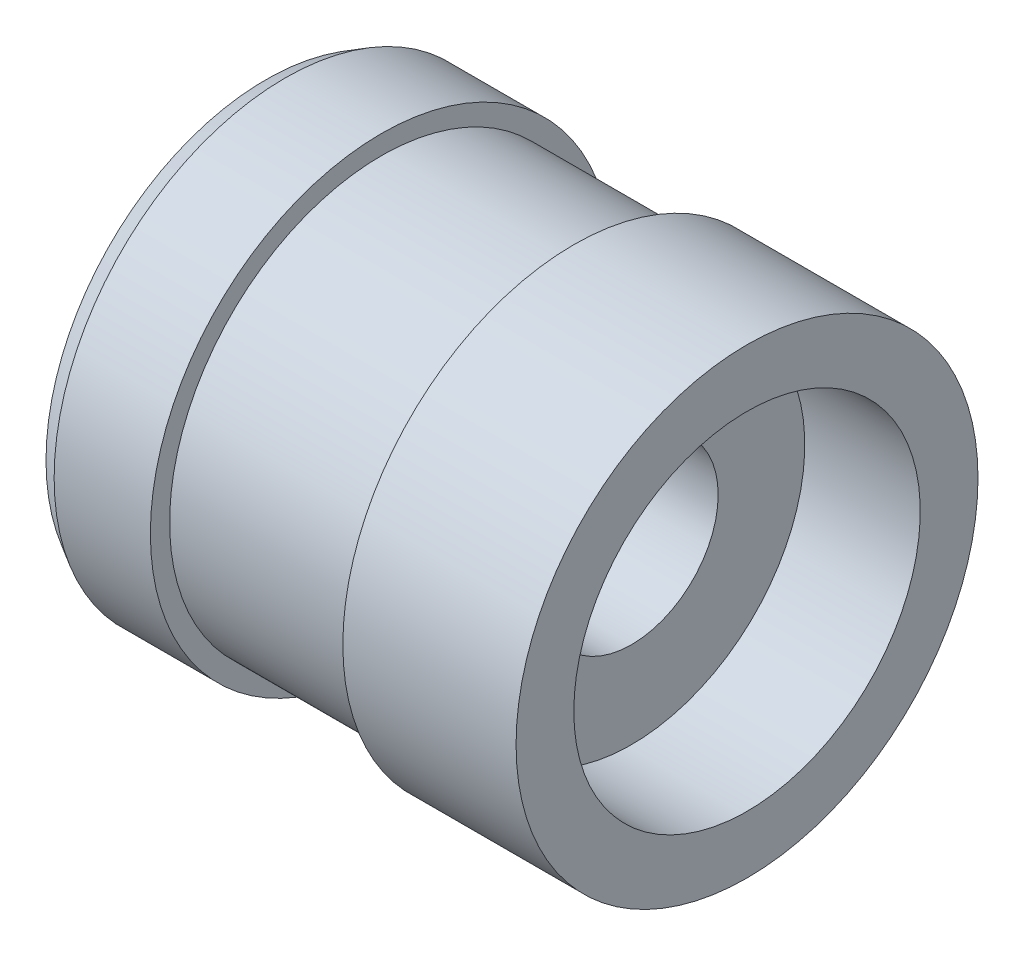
from build123d import *

# Parameters (mm, degrees)
CHANFREIN1_SIZE  = 0.5
CHANFREIN1_SIZE2 = 0.288675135


with BuildPart() as part:
    # Esquisse1 → R_volution1 (revolve)
    with BuildSketch(Plane.XY, mode=Mode.PRIVATE) as r_volution1_sk:
        Polygon((0, 6), (0, 0), (12.5, 0), (12.5, 6), (8, 6), (8, 5.5), (3, 5.5), (3, 6), align=None)
    revolve(r_volution1_sk.sketch.rotate(Axis((0, 0, 0), (1, 0, 0)), 270), axis=Axis((0, 0, 0), (1, 0, 0)))

    # Esquisse2 → Enl_vement de mati_re-R_volution1 (revolve, cut)
    with BuildSketch(Plane(origin=(0, 0, 0), x_dir=(-1, 0, 0), z_dir=(0, 0, -1)), mode=Mode.PRIVATE) as enl_vement_de_mati_re_r_volution1_sk:
        Polygon((-12.5, 4.5), (-12.5, 0), (0, 0), (0, 0.75), (-1.5, 0.75), (-1.5, 2), (-6.5, 2), (-6.5, 2.25), (-9.5, 2.25), (-9.5, 4.5), align=None)
    revolve(enl_vement_de_mati_re_r_volution1_sk.sketch.rotate(Axis((12.5, 0, 0), (-1, 0, 0)), 270), axis=Axis((12.5, 0, 0), (-1, 0, 0)), mode=Mode.SUBTRACT)

    # Chanfrein1
    chanfrein1_edges = [part.edges().sort_by_distance(p)[0] for p in [
        (0, 0, 6),
    ]]
    chanfrein1_side = [part.faces().sort_by_distance(p)[0] for p in [
        (1.5, 0, 6),
    ]]
    chamfer(chanfrein1_edges, length=CHANFREIN1_SIZE, length2=CHANFREIN1_SIZE2, reference=chanfrein1_side[0])


solid = part.part
